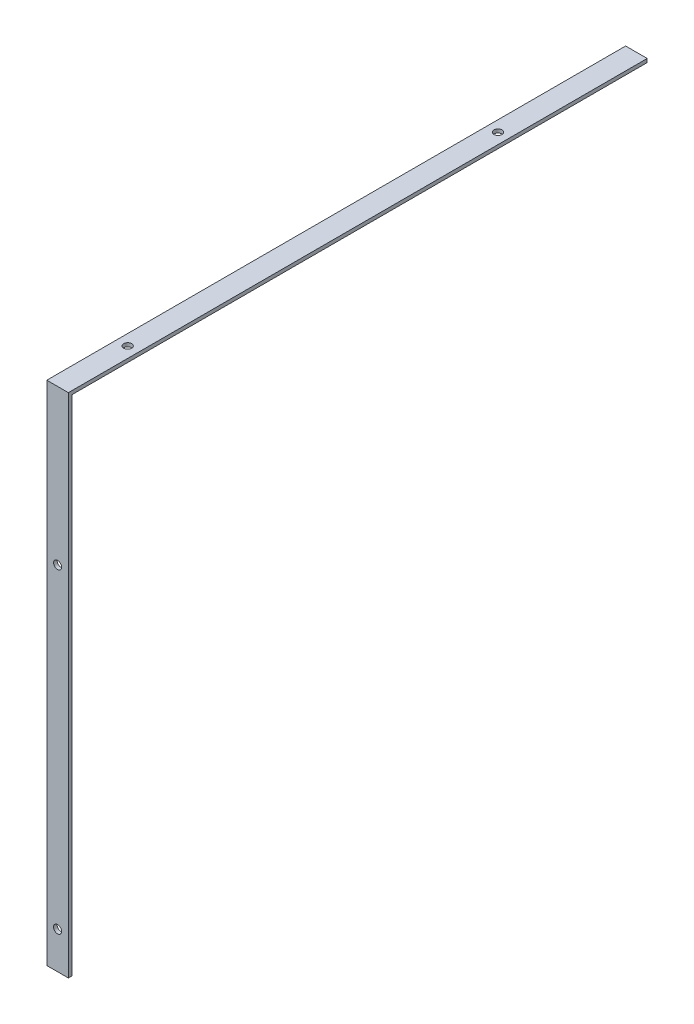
from build123d import *

# Parameters (mm, degrees)
EXTRUDE_THIN1_DEPTH = 15.24
SKETCH2_R           = 2.8575
SKETCH2_R_2         = 2.8321
CUT_EXTRUDE1_DEPTH  = 2.54
SKETCH3_R           = 2.8321
CUT_EXTRUDE2_DEPTH  = 2.54


with BuildPart() as part:
    # Sketch1 → Extrude-Thin1 (new body)
    with BuildSketch(Plane(origin=(0, 0, 0), x_dir=(0, 0, -1), z_dir=(1, 0, 0))):
        Polygon((0, 0), (-406.4, 0), (-406.4, -355.6), (-408.94, -355.6), (-408.94, 2.54), (0, 2.54), align=None)
    extrude(amount=EXTRUDE_THIN1_DEPTH)

    # Sketch2 → Cut-Extrude1 (cut)
    with BuildSketch(Plane.XZ):
        with Locations(Location((7.62, 97.79, 0), (0, 0, 270))):
            Circle(SKETCH2_R)
        with Locations(Location((7.62, 359.41, 0), (0, 0, 270))):
            Circle(SKETCH2_R_2)
    extrude(amount=-CUT_EXTRUDE1_DEPTH, mode=Mode.SUBTRACT)

    # Sketch3 → Cut-Extrude2 (cut)
    with BuildSketch(Plane(origin=(0, 0, 406.4), x_dir=(-1, 0, 0), z_dir=(0, 0, -1))):
        with Locations(Location((-7.62, -329.563501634, 0), (0, 0, 90))):
            Circle(SKETCH3_R)
        with Locations(Location((-7.62, -106.68, 0), (0, 0, 90))):
            Circle(SKETCH3_R)
    extrude(amount=-CUT_EXTRUDE2_DEPTH, mode=Mode.SUBTRACT)


solid = part.part
